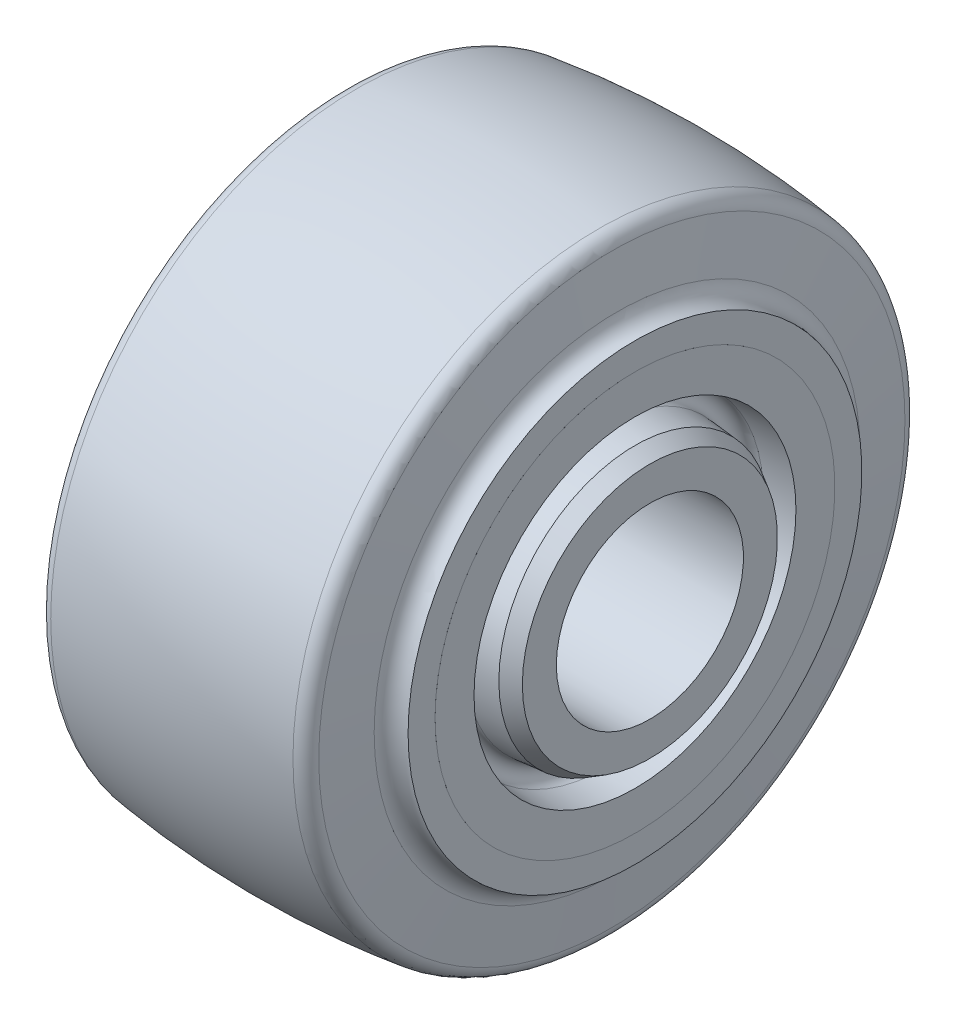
ISO-10303-21;
HEADER;
FILE_DESCRIPTION(('STEP AP214'),'2;1');
FILE_NAME('part.step','',(''),(''),'','','');
FILE_SCHEMA(('AUTOMOTIVE_DESIGN { 1 0 10303 214 1 1 1 1 }'));
ENDSEC;
DATA;
#1=APPLICATION_CONTEXT('core data for automotive mechanical design processes');
#2=APPLICATION_PROTOCOL_DEFINITION('international standard','automotive_design',2000,#1);
#3=PRODUCT_CONTEXT('',#1,'mechanical');
#4=PRODUCT('Part','Part','',(#3));
#5=PRODUCT_RELATED_PRODUCT_CATEGORY('part','',(#4));
#6=PRODUCT_DEFINITION_FORMATION('','',#4);
#7=PRODUCT_DEFINITION_CONTEXT('part definition',#1,'design');
#8=PRODUCT_DEFINITION('design','',#6,#7);
#9=PRODUCT_DEFINITION_SHAPE('','',#8);
#10=(LENGTH_UNIT() NAMED_UNIT(*) SI_UNIT(.MILLI.,.METRE.));
#11=(NAMED_UNIT(*) PLANE_ANGLE_UNIT() SI_UNIT($,.RADIAN.));
#12=(NAMED_UNIT(*) SI_UNIT($,.STERADIAN.) SOLID_ANGLE_UNIT());
#13=UNCERTAINTY_MEASURE_WITH_UNIT(LENGTH_MEASURE(1.E-05),#10,'distance_accuracy_value','');
#14=(GEOMETRIC_REPRESENTATION_CONTEXT(3) GLOBAL_UNCERTAINTY_ASSIGNED_CONTEXT((#13)) GLOBAL_UNIT_ASSIGNED_CONTEXT((#10,
#11,#12)) REPRESENTATION_CONTEXT('',''));
#15=CARTESIAN_POINT('',(0.,0.,0.));
#16=DIRECTION('',(0.,0.,1.));
#17=DIRECTION('',(1.,0.,0.));
#18=AXIS2_PLACEMENT_3D('',#15,#16,#17);
#19=CARTESIAN_POINT('',(25.4,0.,0.));
#20=DIRECTION('',(-1.,0.,0.));
#21=DIRECTION('',(0.,0.,1.));
#22=AXIS2_PLACEMENT_3D('',#19,#20,#21);
#23=CONICAL_SURFACE('',#22,22.030646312,0.0872664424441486);
#24=CARTESIAN_POINT('',(20.5308903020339,0.,0.));
#25=DIRECTION('',(-1.,0.,0.));
#26=DIRECTION('',(0.,0.,1.));
#27=AXIS2_PLACEMENT_3D('',#24,#25,#26);
#28=CIRCLE('',#27,22.4566381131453);
#29=CARTESIAN_POINT('',(20.5308903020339,0.,22.4566381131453));
#30=VERTEX_POINT('',#29);
#31=EDGE_CURVE('E10',#30,#30,#28,.T.);
#32=ORIENTED_EDGE('',*,*,#31,.F.);
#33=EDGE_LOOP('',(#32));
#34=FACE_BOUND('',#33,.T.);
#35=CARTESIAN_POINT('',(25.4,0.,0.));
#36=DIRECTION('',(-1.,0.,0.));
#37=DIRECTION('',(0.,0.,1.));
#38=AXIS2_PLACEMENT_3D('',#35,#36,#37);
#39=CIRCLE('',#38,22.030646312);
#40=CARTESIAN_POINT('',(25.4,0.,22.030646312));
#41=VERTEX_POINT('',#40);
#42=EDGE_CURVE('E436',#41,#41,#39,.T.);
#43=ORIENTED_EDGE('',*,*,#42,.T.);
#44=EDGE_LOOP('',(#43));
#45=FACE_BOUND('',#44,.T.);
#46=ADVANCED_FACE('F360',(#34,#45),#23,.T.);
#47=CARTESIAN_POINT('',(20.6692500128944,0.,0.));
#48=DIRECTION('',(-1.,0.,0.));
#49=DIRECTION('',(0.,0.,1.));
#50=AXIS2_PLACEMENT_3D('',#47,#48,#49);
#51=TOROIDAL_SURFACE('',#50,24.038097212,1.58750001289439);
#52=CARTESIAN_POINT('',(20.5308903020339,0.,0.));
#53=DIRECTION('',(-1.,0.,0.));
#54=DIRECTION('',(0.,0.,1.));
#55=AXIS2_PLACEMENT_3D('',#52,#53,#54);
#56=CIRCLE('',#55,25.6195563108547);
#57=CARTESIAN_POINT('',(20.5308903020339,0.,25.6195563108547));
#58=VERTEX_POINT('',#57);
#59=EDGE_CURVE('E366',#58,#58,#56,.T.);
#60=ORIENTED_EDGE('',*,*,#59,.F.);
#61=EDGE_LOOP('',(#60));
#62=FACE_BOUND('',#61,.T.);
#63=ORIENTED_EDGE('',*,*,#31,.T.);
#64=EDGE_LOOP('',(#63));
#65=FACE_BOUND('',#64,.T.);
#66=ADVANCED_FACE('F569',(#62,#65),#51,.F.);
#67=CARTESIAN_POINT('',(20.5308903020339,0.,0.));
#68=DIRECTION('',(1.,0.,0.));
#69=DIRECTION('',(0.,0.,-1.));
#70=AXIS2_PLACEMENT_3D('',#67,#68,#69);
#71=CONICAL_SURFACE('',#70,25.6195563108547,0.0872664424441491);
#72=CARTESIAN_POINT('',(25.4,0.,0.));
#73=DIRECTION('',(-1.,0.,0.));
#74=DIRECTION('',(0.,0.,1.));
#75=AXIS2_PLACEMENT_3D('',#72,#73,#74);
#76=CIRCLE('',#75,26.045548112);
#77=CARTESIAN_POINT('',(25.4,0.,26.045548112));
#78=VERTEX_POINT('',#77);
#79=EDGE_CURVE('E370',#78,#78,#76,.T.);
#80=ORIENTED_EDGE('',*,*,#79,.F.);
#81=EDGE_LOOP('',(#80));
#82=FACE_BOUND('',#81,.T.);
#83=ORIENTED_EDGE('',*,*,#59,.T.);
#84=EDGE_LOOP('',(#83));
#85=FACE_BOUND('',#84,.T.);
#86=ADVANCED_FACE('F564',(#82,#85),#71,.F.);
#87=CARTESIAN_POINT('',(25.4,26.045548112,0.));
#88=DIRECTION('',(-1.,0.,0.));
#89=DIRECTION('',(0.,0.,1.));
#90=AXIS2_PLACEMENT_3D('',#87,#88,#89);
#91=PLANE('',#90);
#92=CARTESIAN_POINT('',(25.4,0.,0.));
#93=DIRECTION('',(-1.,0.,0.));
#94=DIRECTION('',(0.,0.,1.));
#95=AXIS2_PLACEMENT_3D('',#92,#93,#94);
#96=CIRCLE('',#95,32.3453125);
#97=CARTESIAN_POINT('',(25.4,0.,32.3453125));
#98=VERTEX_POINT('',#97);
#99=EDGE_CURVE('E374',#98,#98,#96,.T.);
#100=ORIENTED_EDGE('',*,*,#99,.F.);
#101=EDGE_LOOP('',(#100));
#102=FACE_BOUND('',#101,.T.);
#103=ORIENTED_EDGE('',*,*,#79,.T.);
#104=EDGE_LOOP('',(#103));
#105=FACE_BOUND('',#104,.T.);
#106=ADVANCED_FACE('F558',(#102,#105),#91,.F.);
#107=CARTESIAN_POINT('',(-38.862204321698,0.,0.));
#108=DIRECTION('',(-1.,0.,0.));
#109=DIRECTION('',(0.,0.,1.));
#110=AXIS2_PLACEMENT_3D('',#107,#108,#109);
#111=CYLINDRICAL_SURFACE('',#110,32.3453125);
#112=CARTESIAN_POINT('',(25.39746,0.,0.));
#113=DIRECTION('',(-1.,0.,0.));
#114=DIRECTION('',(0.,0.,1.));
#115=AXIS2_PLACEMENT_3D('',#112,#113,#114);
#116=CIRCLE('',#115,32.3453125);
#117=CARTESIAN_POINT('',(25.39746,0.,32.3453125));
#118=VERTEX_POINT('',#117);
#119=EDGE_CURVE('E379',#118,#118,#116,.T.);
#120=ORIENTED_EDGE('',*,*,#119,.F.);
#121=EDGE_LOOP('',(#120));
#122=FACE_BOUND('',#121,.T.);
#123=ORIENTED_EDGE('',*,*,#99,.T.);
#124=EDGE_LOOP('',(#123));
#125=FACE_BOUND('',#124,.T.);
#126=ADVANCED_FACE('F552',(#122,#125),#111,.T.);
#127=CARTESIAN_POINT('',(25.39746,32.3453125,0.));
#128=DIRECTION('',(-1.,0.,0.));
#129=DIRECTION('',(0.,0.,1.));
#130=AXIS2_PLACEMENT_3D('',#127,#128,#129);
#131=PLANE('',#130);
#132=CARTESIAN_POINT('',(25.39746,0.,0.));
#133=DIRECTION('',(-1.,0.,0.));
#134=DIRECTION('',(0.,0.,1.));
#135=AXIS2_PLACEMENT_3D('',#132,#133,#134);
#136=CIRCLE('',#135,36.7109375);
#137=CARTESIAN_POINT('',(25.39746,0.,36.7109375));
#138=VERTEX_POINT('',#137);
#139=EDGE_CURVE('E382',#138,#138,#136,.T.);
#140=ORIENTED_EDGE('',*,*,#139,.F.);
#141=EDGE_LOOP('',(#140));
#142=FACE_BOUND('',#141,.T.);
#143=ORIENTED_EDGE('',*,*,#119,.T.);
#144=EDGE_LOOP('',(#143));
#145=FACE_BOUND('',#144,.T.);
#146=ADVANCED_FACE('F546',(#142,#145),#131,.F.);
#147=CARTESIAN_POINT('',(25.39746,0.,0.));
#148=DIRECTION('',(-1.,0.,0.));
#149=DIRECTION('',(0.,0.,1.));
#150=AXIS2_PLACEMENT_3D('',#147,#148,#149);
#151=TOROIDAL_SURFACE('',#150,39.6132846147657,2.90234711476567);
#152=CARTESIAN_POINT('',(22.5110122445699,0.,0.));
#153=DIRECTION('',(-1.,0.,0.));
#154=DIRECTION('',(0.,0.,1.));
#155=AXIS2_PLACEMENT_3D('',#152,#153,#154);
#156=CIRCLE('',#155,39.3099067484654);
#157=CARTESIAN_POINT('',(22.5110122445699,0.,39.3099067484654));
#158=VERTEX_POINT('',#157);
#159=EDGE_CURVE('E385',#158,#158,#156,.T.);
#160=ORIENTED_EDGE('',*,*,#159,.F.);
#161=EDGE_LOOP('',(#160));
#162=FACE_BOUND('',#161,.T.);
#163=ORIENTED_EDGE('',*,*,#139,.T.);
#164=EDGE_LOOP('',(#163));
#165=FACE_BOUND('',#164,.T.);
#166=ADVANCED_FACE('F540',(#162,#165),#151,.F.);
#167=CARTESIAN_POINT('',(22.5110122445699,0.,0.));
#168=DIRECTION('',(-1.,0.,0.));
#169=DIRECTION('',(0.,0.,1.));
#170=AXIS2_PLACEMENT_3D('',#167,#168,#169);
#171=CONICAL_SURFACE('',#170,39.3099067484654,1.46607657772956);
#172=CARTESIAN_POINT('',(21.6583679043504,0.,0.));
#173=DIRECTION('',(-1.,0.,0.));
#174=DIRECTION('',(0.,0.,1.));
#175=AXIS2_PLACEMENT_3D('',#172,#173,#174);
#176=CIRCLE('',#175,47.4222762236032);
#177=CARTESIAN_POINT('',(21.6583679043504,0.,47.4222762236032));
#178=VERTEX_POINT('',#177);
#179=EDGE_CURVE('E388',#178,#178,#176,.T.);
#180=ORIENTED_EDGE('',*,*,#179,.F.);
#181=EDGE_LOOP('',(#180));
#182=FACE_BOUND('',#181,.T.);
#183=ORIENTED_EDGE('',*,*,#159,.T.);
#184=EDGE_LOOP('',(#183));
#185=FACE_BOUND('',#184,.T.);
#186=ADVANCED_FACE('F534',(#182,#185),#171,.T.);
#187=CARTESIAN_POINT('',(19.2901626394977,0.,0.));
#188=DIRECTION('',(-1.,0.,0.));
#189=DIRECTION('',(0.,0.,1.));
#190=AXIS2_PLACEMENT_3D('',#187,#188,#189);
#191=TOROIDAL_SURFACE('',#190,47.173367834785,2.38124999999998);
#192=CARTESIAN_POINT('',(19.5963556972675,0.,0.));
#193=DIRECTION('',(-1.,0.,0.));
#194=DIRECTION('',(0.,0.,1.));
#195=AXIS2_PLACEMENT_3D('',#192,#193,#194);
#196=CIRCLE('',#195,49.5348498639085);
#197=CARTESIAN_POINT('',(19.5963556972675,0.,49.5348498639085));
#198=VERTEX_POINT('',#197);
#199=EDGE_CURVE('E391',#198,#198,#196,.T.);
#200=ORIENTED_EDGE('',*,*,#199,.F.);
#201=EDGE_LOOP('',(#200));
#202=FACE_BOUND('',#201,.T.);
#203=ORIENTED_EDGE('',*,*,#179,.T.);
#204=EDGE_LOOP('',(#203));
#205=FACE_BOUND('',#204,.T.);
#206=ADVANCED_FACE('F528',(#202,#205),#191,.T.);
#207=CARTESIAN_POINT('',(0.,0.,0.));
#208=DIRECTION('',(-1.,0.,0.));
#209=DIRECTION('',(0.,0.,1.));
#210=AXIS2_PLACEMENT_3D('',#207,#208,#209);
#211=DEGENERATE_TOROIDAL_SURFACE('',#210,101.6,152.4,.F.);
#212=CARTESIAN_POINT('',(-19.5963556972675,0.,0.));
#213=DIRECTION('',(-1.,0.,0.));
#214=DIRECTION('',(0.,0.,1.));
#215=AXIS2_PLACEMENT_3D('',#212,#213,#214);
#216=CIRCLE('',#215,49.5348498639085);
#217=CARTESIAN_POINT('',(-19.5963556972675,0.,49.5348498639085));
#218=VERTEX_POINT('',#217);
#219=EDGE_CURVE('E394',#218,#218,#216,.T.);
#220=ORIENTED_EDGE('',*,*,#219,.F.);
#221=EDGE_LOOP('',(#220));
#222=FACE_BOUND('',#221,.T.);
#223=ORIENTED_EDGE('',*,*,#199,.T.);
#224=EDGE_LOOP('',(#223));
#225=FACE_BOUND('',#224,.T.);
#226=ADVANCED_FACE('F522',(#222,#225),#211,.F.);
#227=CARTESIAN_POINT('',(-19.2901626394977,0.,0.));
#228=DIRECTION('',(-1.,0.,0.));
#229=DIRECTION('',(0.,0.,1.));
#230=AXIS2_PLACEMENT_3D('',#227,#228,#229);
#231=TOROIDAL_SURFACE('',#230,47.173367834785,2.38124999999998);
#232=CARTESIAN_POINT('',(-21.6583679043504,0.,0.));
#233=DIRECTION('',(-1.,0.,0.));
#234=DIRECTION('',(0.,0.,1.));
#235=AXIS2_PLACEMENT_3D('',#232,#233,#234);
#236=CIRCLE('',#235,47.4222762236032);
#237=CARTESIAN_POINT('',(-21.6583679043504,0.,47.4222762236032));
#238=VERTEX_POINT('',#237);
#239=EDGE_CURVE('E397',#238,#238,#236,.T.);
#240=ORIENTED_EDGE('',*,*,#239,.F.);
#241=EDGE_LOOP('',(#240));
#242=FACE_BOUND('',#241,.T.);
#243=ORIENTED_EDGE('',*,*,#219,.T.);
#244=EDGE_LOOP('',(#243));
#245=FACE_BOUND('',#244,.T.);
#246=ADVANCED_FACE('F516',(#242,#245),#231,.T.);
#247=CARTESIAN_POINT('',(-21.6583679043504,0.,0.));
#248=DIRECTION('',(1.,0.,0.));
#249=DIRECTION('',(0.,0.,-1.));
#250=AXIS2_PLACEMENT_3D('',#247,#248,#249);
#251=CONICAL_SURFACE('',#250,47.4222762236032,1.46607657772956);
#252=CARTESIAN_POINT('',(-22.5110122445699,0.,0.));
#253=DIRECTION('',(-1.,0.,0.));
#254=DIRECTION('',(0.,0.,1.));
#255=AXIS2_PLACEMENT_3D('',#252,#253,#254);
#256=CIRCLE('',#255,39.3099067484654);
#257=CARTESIAN_POINT('',(-22.5110122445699,0.,39.3099067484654));
#258=VERTEX_POINT('',#257);
#259=EDGE_CURVE('E400',#258,#258,#256,.T.);
#260=ORIENTED_EDGE('',*,*,#259,.F.);
#261=EDGE_LOOP('',(#260));
#262=FACE_BOUND('',#261,.T.);
#263=ORIENTED_EDGE('',*,*,#239,.T.);
#264=EDGE_LOOP('',(#263));
#265=FACE_BOUND('',#264,.T.);
#266=ADVANCED_FACE('F510',(#262,#265),#251,.T.);
#267=CARTESIAN_POINT('',(-25.39746,0.,0.));
#268=DIRECTION('',(-1.,0.,0.));
#269=DIRECTION('',(0.,0.,1.));
#270=AXIS2_PLACEMENT_3D('',#267,#268,#269);
#271=TOROIDAL_SURFACE('',#270,39.6132846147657,2.90234711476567);
#272=CARTESIAN_POINT('',(-25.39746,0.,0.));
#273=DIRECTION('',(-1.,0.,0.));
#274=DIRECTION('',(0.,0.,1.));
#275=AXIS2_PLACEMENT_3D('',#272,#273,#274);
#276=CIRCLE('',#275,36.7109375);
#277=CARTESIAN_POINT('',(-25.39746,0.,36.7109375));
#278=VERTEX_POINT('',#277);
#279=EDGE_CURVE('E403',#278,#278,#276,.T.);
#280=ORIENTED_EDGE('',*,*,#279,.F.);
#281=EDGE_LOOP('',(#280));
#282=FACE_BOUND('',#281,.T.);
#283=ORIENTED_EDGE('',*,*,#259,.T.);
#284=EDGE_LOOP('',(#283));
#285=FACE_BOUND('',#284,.T.);
#286=ADVANCED_FACE('F504',(#282,#285),#271,.F.);
#287=CARTESIAN_POINT('',(-25.39746,36.7109375,0.));
#288=DIRECTION('',(1.,0.,0.));
#289=DIRECTION('',(0.,0.,-1.));
#290=AXIS2_PLACEMENT_3D('',#287,#288,#289);
#291=PLANE('',#290);
#292=CARTESIAN_POINT('',(-25.39746,0.,0.));
#293=DIRECTION('',(-1.,0.,0.));
#294=DIRECTION('',(0.,0.,1.));
#295=AXIS2_PLACEMENT_3D('',#292,#293,#294);
#296=CIRCLE('',#295,32.3453125);
#297=CARTESIAN_POINT('',(-25.39746,0.,32.3453125));
#298=VERTEX_POINT('',#297);
#299=EDGE_CURVE('E406',#298,#298,#296,.T.);
#300=ORIENTED_EDGE('',*,*,#299,.F.);
#301=EDGE_LOOP('',(#300));
#302=FACE_BOUND('',#301,.T.);
#303=ORIENTED_EDGE('',*,*,#279,.T.);
#304=EDGE_LOOP('',(#303));
#305=FACE_BOUND('',#304,.T.);
#306=ADVANCED_FACE('F498',(#302,#305),#291,.F.);
#307=CARTESIAN_POINT('',(-38.862204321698,0.,0.));
#308=DIRECTION('',(-1.,0.,0.));
#309=DIRECTION('',(0.,0.,1.));
#310=AXIS2_PLACEMENT_3D('',#307,#308,#309);
#311=CYLINDRICAL_SURFACE('',#310,32.3453125);
#312=CARTESIAN_POINT('',(-25.4,0.,0.));
#313=DIRECTION('',(-1.,0.,0.));
#314=DIRECTION('',(0.,0.,1.));
#315=AXIS2_PLACEMENT_3D('',#312,#313,#314);
#316=CIRCLE('',#315,32.3453125);
#317=CARTESIAN_POINT('',(-25.4,0.,32.3453125));
#318=VERTEX_POINT('',#317);
#319=EDGE_CURVE('E409',#318,#318,#316,.T.);
#320=ORIENTED_EDGE('',*,*,#319,.F.);
#321=EDGE_LOOP('',(#320));
#322=FACE_BOUND('',#321,.T.);
#323=ORIENTED_EDGE('',*,*,#299,.T.);
#324=EDGE_LOOP('',(#323));
#325=FACE_BOUND('',#324,.T.);
#326=ADVANCED_FACE('F492',(#322,#325),#311,.T.);
#327=CARTESIAN_POINT('',(-25.4,32.3453125,0.));
#328=DIRECTION('',(1.,0.,0.));
#329=DIRECTION('',(0.,0.,-1.));
#330=AXIS2_PLACEMENT_3D('',#327,#328,#329);
#331=PLANE('',#330);
#332=CARTESIAN_POINT('',(-25.4,0.,0.));
#333=DIRECTION('',(-1.,0.,0.));
#334=DIRECTION('',(0.,0.,1.));
#335=AXIS2_PLACEMENT_3D('',#332,#333,#334);
#336=CIRCLE('',#335,26.045548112);
#337=CARTESIAN_POINT('',(-25.4,0.,26.045548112));
#338=VERTEX_POINT('',#337);
#339=EDGE_CURVE('E412',#338,#338,#336,.T.);
#340=ORIENTED_EDGE('',*,*,#339,.F.);
#341=EDGE_LOOP('',(#340));
#342=FACE_BOUND('',#341,.T.);
#343=ORIENTED_EDGE('',*,*,#319,.T.);
#344=EDGE_LOOP('',(#343));
#345=FACE_BOUND('',#344,.T.);
#346=ADVANCED_FACE('F486',(#342,#345),#331,.F.);
#347=CARTESIAN_POINT('',(-25.4,0.,0.));
#348=DIRECTION('',(-1.,0.,0.));
#349=DIRECTION('',(0.,0.,1.));
#350=AXIS2_PLACEMENT_3D('',#347,#348,#349);
#351=CONICAL_SURFACE('',#350,26.045548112,0.087266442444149);
#352=CARTESIAN_POINT('',(-20.5308903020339,0.,0.));
#353=DIRECTION('',(-1.,0.,0.));
#354=DIRECTION('',(0.,0.,1.));
#355=AXIS2_PLACEMENT_3D('',#352,#353,#354);
#356=CIRCLE('',#355,25.6195563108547);
#357=CARTESIAN_POINT('',(-20.5308903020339,0.,25.6195563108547));
#358=VERTEX_POINT('',#357);
#359=EDGE_CURVE('E415',#358,#358,#356,.T.);
#360=ORIENTED_EDGE('',*,*,#359,.F.);
#361=EDGE_LOOP('',(#360));
#362=FACE_BOUND('',#361,.T.);
#363=ORIENTED_EDGE('',*,*,#339,.T.);
#364=EDGE_LOOP('',(#363));
#365=FACE_BOUND('',#364,.T.);
#366=ADVANCED_FACE('F480',(#362,#365),#351,.F.);
#367=CARTESIAN_POINT('',(-20.6692500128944,0.,0.));
#368=DIRECTION('',(-1.,0.,0.));
#369=DIRECTION('',(0.,0.,1.));
#370=AXIS2_PLACEMENT_3D('',#367,#368,#369);
#371=TOROIDAL_SURFACE('',#370,24.038097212,1.58750001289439);
#372=CARTESIAN_POINT('',(-20.5308903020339,0.,0.));
#373=DIRECTION('',(-1.,0.,0.));
#374=DIRECTION('',(0.,0.,1.));
#375=AXIS2_PLACEMENT_3D('',#372,#373,#374);
#376=CIRCLE('',#375,22.4566381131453);
#377=CARTESIAN_POINT('',(-20.5308903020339,0.,22.4566381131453));
#378=VERTEX_POINT('',#377);
#379=EDGE_CURVE('E418',#378,#378,#376,.T.);
#380=ORIENTED_EDGE('',*,*,#379,.F.);
#381=EDGE_LOOP('',(#380));
#382=FACE_BOUND('',#381,.T.);
#383=ORIENTED_EDGE('',*,*,#359,.T.);
#384=EDGE_LOOP('',(#383));
#385=FACE_BOUND('',#384,.T.);
#386=ADVANCED_FACE('F474',(#382,#385),#371,.F.);
#387=CARTESIAN_POINT('',(-20.5308903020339,0.,0.));
#388=DIRECTION('',(1.,0.,0.));
#389=DIRECTION('',(0.,0.,-1.));
#390=AXIS2_PLACEMENT_3D('',#387,#388,#389);
#391=CONICAL_SURFACE('',#390,22.4566381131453,0.0872664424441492);
#392=CARTESIAN_POINT('',(-25.4,0.,0.));
#393=DIRECTION('',(-1.,0.,0.));
#394=DIRECTION('',(0.,0.,1.));
#395=AXIS2_PLACEMENT_3D('',#392,#393,#394);
#396=CIRCLE('',#395,22.030646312);
#397=CARTESIAN_POINT('',(-25.4,0.,22.030646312));
#398=VERTEX_POINT('',#397);
#399=EDGE_CURVE('E421',#398,#398,#396,.T.);
#400=ORIENTED_EDGE('',*,*,#399,.F.);
#401=EDGE_LOOP('',(#400));
#402=FACE_BOUND('',#401,.T.);
#403=ORIENTED_EDGE('',*,*,#379,.T.);
#404=EDGE_LOOP('',(#403));
#405=FACE_BOUND('',#404,.T.);
#406=ADVANCED_FACE('F468',(#402,#405),#391,.T.);
#407=CARTESIAN_POINT('',(-25.4,0.,0.));
#408=DIRECTION('',(1.,0.,0.));
#409=DIRECTION('',(0.,0.,-1.));
#410=AXIS2_PLACEMENT_3D('',#407,#408,#409);
#411=CONICAL_SURFACE('',#410,22.030646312,0.523598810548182);
#412=CARTESIAN_POINT('',(-27.813,0.,0.));
#413=DIRECTION('',(-1.,0.,0.));
#414=DIRECTION('',(0.,0.,1.));
#415=AXIS2_PLACEMENT_3D('',#412,#413,#414);
#416=CIRCLE('',#415,20.6375);
#417=CARTESIAN_POINT('',(-27.813,0.,20.6375));
#418=VERTEX_POINT('',#417);
#419=EDGE_CURVE('E424',#418,#418,#416,.T.);
#420=ORIENTED_EDGE('',*,*,#419,.F.);
#421=EDGE_LOOP('',(#420));
#422=FACE_BOUND('',#421,.T.);
#423=ORIENTED_EDGE('',*,*,#399,.T.);
#424=EDGE_LOOP('',(#423));
#425=FACE_BOUND('',#424,.T.);
#426=ADVANCED_FACE('F462',(#422,#425),#411,.T.);
#427=CARTESIAN_POINT('',(-27.813,15.1384,0.));
#428=DIRECTION('',(1.,0.,0.));
#429=DIRECTION('',(0.,0.,-1.));
#430=AXIS2_PLACEMENT_3D('',#427,#428,#429);
#431=PLANE('',#430);
#432=CARTESIAN_POINT('',(-27.813,0.,0.));
#433=DIRECTION('',(-1.,0.,0.));
#434=DIRECTION('',(0.,0.,1.));
#435=AXIS2_PLACEMENT_3D('',#432,#433,#434);
#436=CIRCLE('',#435,15.1384);
#437=CARTESIAN_POINT('',(-27.813,0.,15.1384));
#438=VERTEX_POINT('',#437);
#439=EDGE_CURVE('E427',#438,#438,#436,.T.);
#440=ORIENTED_EDGE('',*,*,#439,.F.);
#441=EDGE_LOOP('',(#440));
#442=FACE_BOUND('',#441,.T.);
#443=ORIENTED_EDGE('',*,*,#419,.T.);
#444=EDGE_LOOP('',(#443));
#445=FACE_BOUND('',#444,.T.);
#446=ADVANCED_FACE('F456',(#442,#445),#431,.F.);
#447=CARTESIAN_POINT('',(-38.862204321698,0.,0.));
#448=DIRECTION('',(-1.,0.,0.));
#449=DIRECTION('',(0.,0.,1.));
#450=AXIS2_PLACEMENT_3D('',#447,#448,#449);
#451=CYLINDRICAL_SURFACE('',#450,15.1384);
#452=CARTESIAN_POINT('',(27.813,0.,0.));
#453=DIRECTION('',(-1.,0.,0.));
#454=DIRECTION('',(0.,0.,1.));
#455=AXIS2_PLACEMENT_3D('',#452,#453,#454);
#456=CIRCLE('',#455,15.1384);
#457=CARTESIAN_POINT('',(27.813,0.,15.1384));
#458=VERTEX_POINT('',#457);
#459=EDGE_CURVE('E430',#458,#458,#456,.T.);
#460=ORIENTED_EDGE('',*,*,#459,.F.);
#461=EDGE_LOOP('',(#460));
#462=FACE_BOUND('',#461,.T.);
#463=ORIENTED_EDGE('',*,*,#439,.T.);
#464=EDGE_LOOP('',(#463));
#465=FACE_BOUND('',#464,.T.);
#466=ADVANCED_FACE('F450',(#462,#465),#451,.F.);
#467=CARTESIAN_POINT('',(27.813,20.6375,0.));
#468=DIRECTION('',(-1.,0.,0.));
#469=DIRECTION('',(0.,0.,1.));
#470=AXIS2_PLACEMENT_3D('',#467,#468,#469);
#471=PLANE('',#470);
#472=CARTESIAN_POINT('',(27.813,0.,0.));
#473=DIRECTION('',(-1.,0.,0.));
#474=DIRECTION('',(0.,0.,1.));
#475=AXIS2_PLACEMENT_3D('',#472,#473,#474);
#476=CIRCLE('',#475,20.6375);
#477=CARTESIAN_POINT('',(27.813,0.,20.6375));
#478=VERTEX_POINT('',#477);
#479=EDGE_CURVE('E433',#478,#478,#476,.T.);
#480=ORIENTED_EDGE('',*,*,#479,.F.);
#481=EDGE_LOOP('',(#480));
#482=FACE_BOUND('',#481,.T.);
#483=ORIENTED_EDGE('',*,*,#459,.T.);
#484=EDGE_LOOP('',(#483));
#485=FACE_BOUND('',#484,.T.);
#486=ADVANCED_FACE('F444',(#482,#485),#471,.F.);
#487=CARTESIAN_POINT('',(27.813,0.,0.));
#488=DIRECTION('',(-1.,0.,0.));
#489=DIRECTION('',(0.,0.,1.));
#490=AXIS2_PLACEMENT_3D('',#487,#488,#489);
#491=CONICAL_SURFACE('',#490,20.6375,0.523598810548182);
#492=ORIENTED_EDGE('',*,*,#42,.F.);
#493=EDGE_LOOP('',(#492));
#494=FACE_BOUND('',#493,.T.);
#495=ORIENTED_EDGE('',*,*,#479,.T.);
#496=EDGE_LOOP('',(#495));
#497=FACE_BOUND('',#496,.T.);
#498=ADVANCED_FACE('F441',(#494,#497),#491,.T.);
#499=CLOSED_SHELL('',(#46,#66,#86,#106,#126,#146,#166,#186,#206,#226,#246,#266,#286,#306,#326,
#346,#366,#386,#406,#426,#446,#466,#486,#498));
#500=MANIFOLD_SOLID_BREP('B2',#499);
#501=ADVANCED_BREP_SHAPE_REPRESENTATION('',(#18,#500),#14);
#502=SHAPE_DEFINITION_REPRESENTATION(#9,#501);
ENDSEC;
END-ISO-10303-21;
